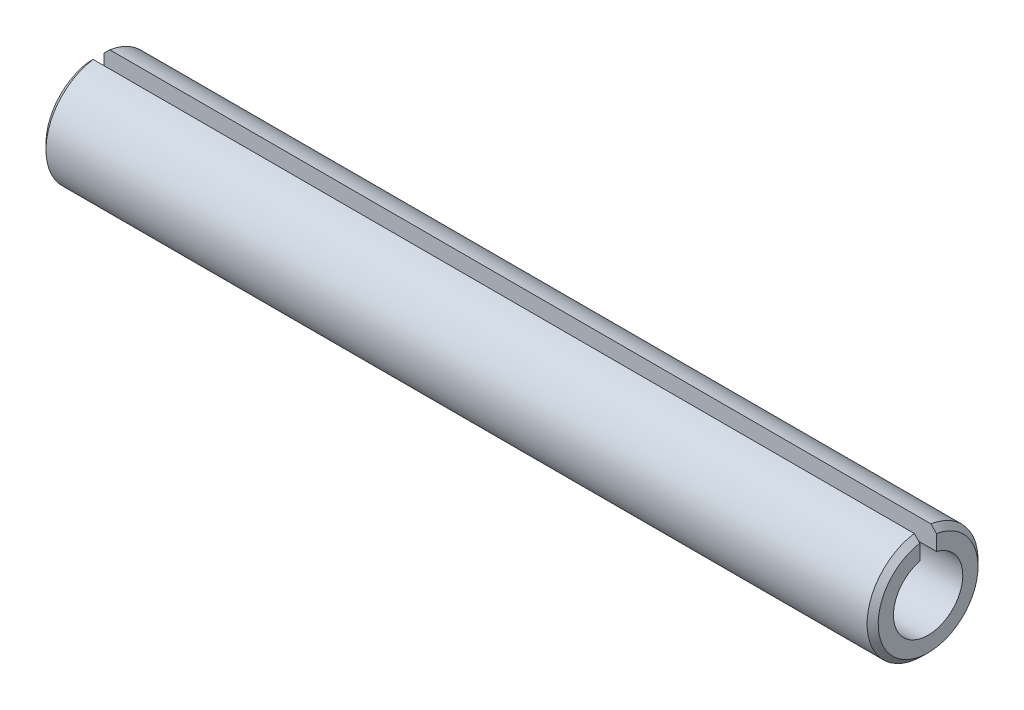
from build123d import *

# Parameters (mm, degrees)
ENL_V_MAT_EXTRU_2_DEPTH = 61.266076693


with BuildPart() as part:
    # Esquisse1 → Base-R_volution (revolve)
    with BuildSketch(Plane.XY, mode=Mode.PRIVATE) as base_r_volution_sk:
        Polygon((0, 2.5), (0, 3.6), (0.4, 4), (59.6, 4), (60, 3.6), (60, 2.5), align=None)
    revolve(base_r_volution_sk.sketch.rotate(Axis((0, 0, 0), (1, 0, 0)), 90), axis=Axis((0, 0, 0), (1, 0, 0)))

    # Esquisse2 → Enl_v. mat.-Extru.2 (cut, through all)
    with BuildSketch(Plane(origin=(0, 0, 0), x_dir=(0, 0, -1), z_dir=(1, 0, 0))):
        with BuildLine():
            Line((0.6, 3.954743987), (0.6, 2.42693222))
            ThreePointArc((0.6, 2.42693222), (0, 2.5), (-0.6, 2.42693222))
            Line((-0.6, 2.42693222), (-0.6, 3.954743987))
            ThreePointArc((-0.6, 3.954743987), (0, 4), (0.6, 3.954743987))
        make_face()
    extrude(amount=ENL_V_MAT_EXTRU_2_DEPTH, mode=Mode.SUBTRACT)


solid = part.part
